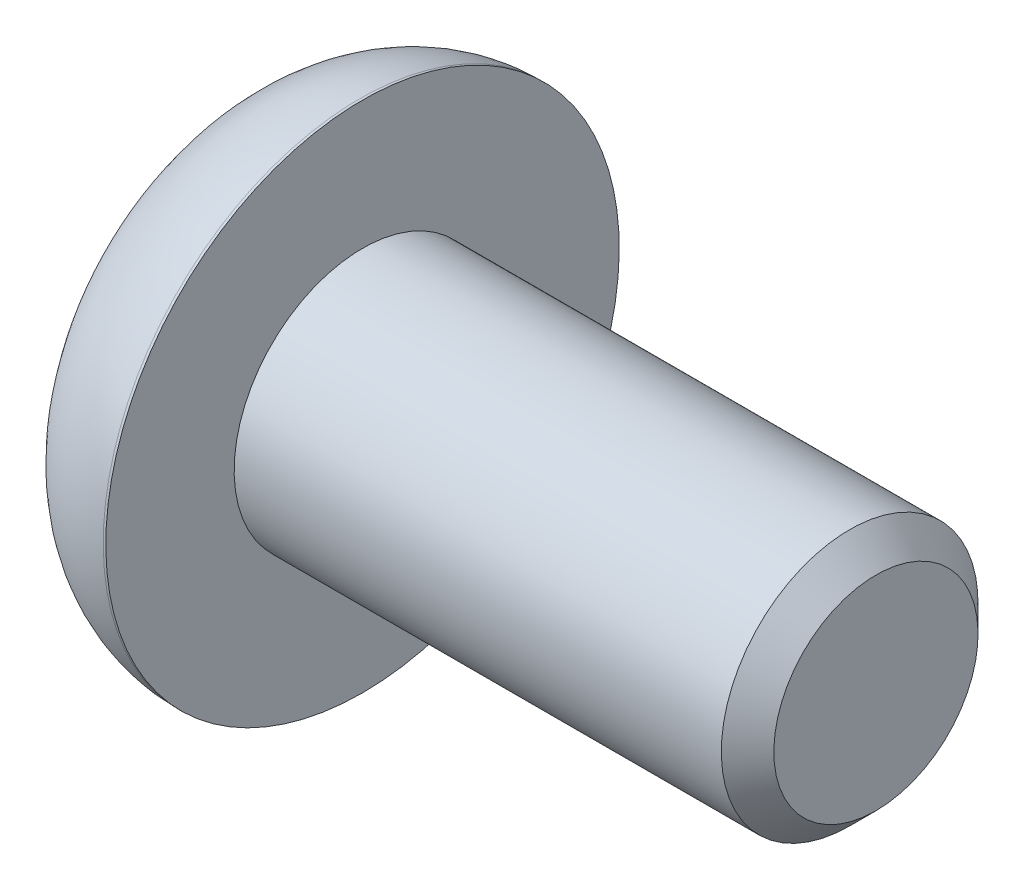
from build123d import *

# Parameters (mm, degrees)
EXTRUSION1_DEPTH = 2.145


with BuildPart() as part:
    # Esquisse1 → R_volution1 (revolve)
    with BuildSketch(Plane.XY, mode=Mode.PRIVATE) as r_volution1_sk:
        with BuildLine():
            Line((0, 0), (0, 2.76))
            ThreePointArc((0, 2.76), (0.948974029, 5.051025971), (3.24, 6))
            Line((3.24, 6), (3.3, 6))
            Line((3.3, 6), (3.3, 3))
            Line((3.3, 3), (14.6865, 3))
            Line((14.6865, 3), (15.3, 2.3865))
            Line((15.3, 2.3865), (15.3, 0))
            Line((15.3, 0), (0, 0))
        make_face()
    revolve(r_volution1_sk.sketch.rotate(Axis((15.3, 0, 0), (-1, 0, 0)), 180), axis=Axis((15.3, 0, 0), (-1, 0, 0)))

    # Esquisse2 → Enl_vement de mati_re-R_volution1 (revolve, cut)
    with BuildSketch(Plane.XY, mode=Mode.PRIVATE) as enl_vement_de_mati_re_r_volution1_sk:
        Polygon((0, 0), (0, 2), (2.145299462, 2), (3.3, 0), align=None)
    revolve(enl_vement_de_mati_re_r_volution1_sk.sketch.rotate(Axis((3.3, 0, 0), (-1, 0, 0)), 270), axis=Axis((3.3, 0, 0), (-1, 0, 0)), mode=Mode.SUBTRACT)

    # Esquisse3 → Extrusion1 (cut)
    with BuildSketch(Plane(origin=(0, 0, 0), x_dir=(0, 0, -1), z_dir=(1, 0, 0))):
        Polygon((-2, 1.154700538), (-2, -1.154700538), (0, -2.309401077), (2, -1.154700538), (2, 1.154700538), (0, 2.309401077), align=None)
    extrude(amount=EXTRUSION1_DEPTH, mode=Mode.SUBTRACT)


solid = part.part
